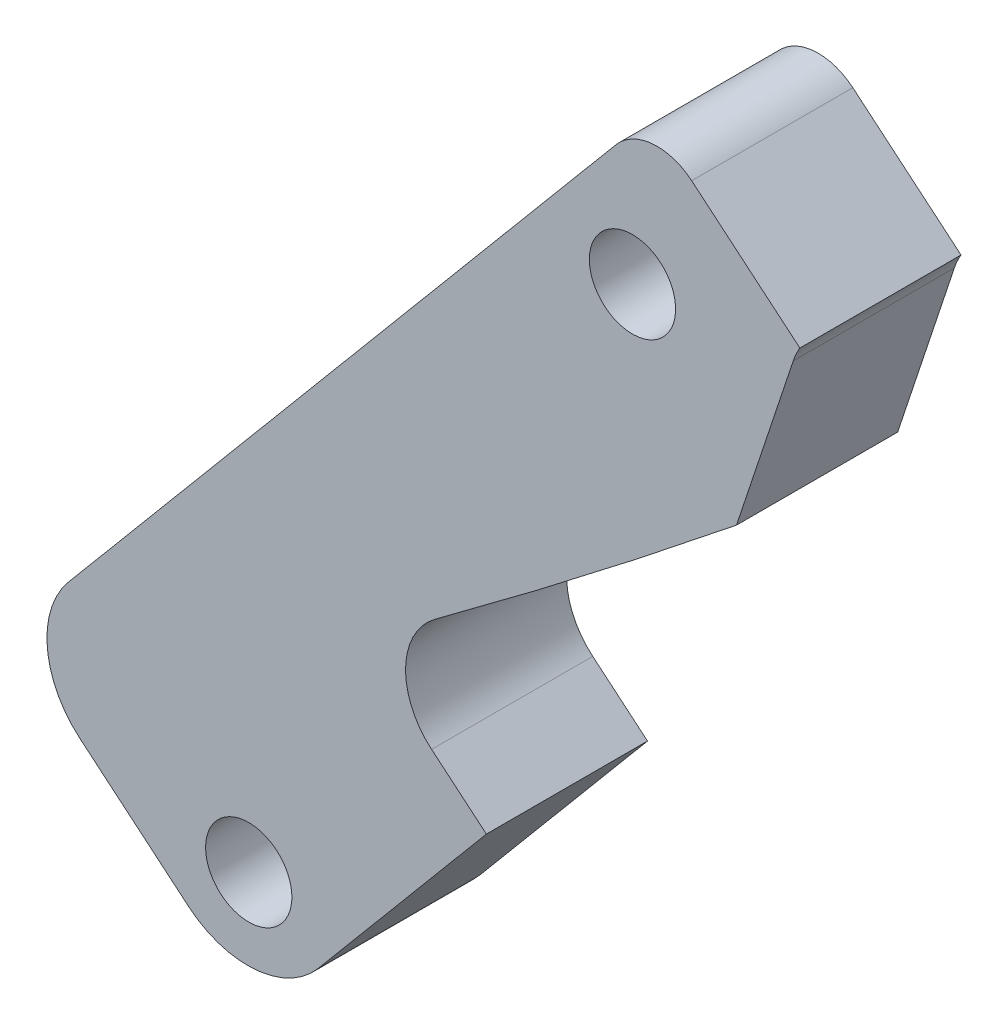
ISO-10303-21;
HEADER;
FILE_DESCRIPTION(('STEP AP214'),'2;1');
FILE_NAME('part.step','',(''),(''),'','','');
FILE_SCHEMA(('AUTOMOTIVE_DESIGN { 1 0 10303 214 1 1 1 1 }'));
ENDSEC;
DATA;
#1=APPLICATION_CONTEXT('core data for automotive mechanical design processes');
#2=APPLICATION_PROTOCOL_DEFINITION('international standard','automotive_design',2000,#1);
#3=PRODUCT_CONTEXT('',#1,'mechanical');
#4=PRODUCT('Part','Part','',(#3));
#5=PRODUCT_RELATED_PRODUCT_CATEGORY('part','',(#4));
#6=PRODUCT_DEFINITION_FORMATION('','',#4);
#7=PRODUCT_DEFINITION_CONTEXT('part definition',#1,'design');
#8=PRODUCT_DEFINITION('design','',#6,#7);
#9=PRODUCT_DEFINITION_SHAPE('','',#8);
#10=(LENGTH_UNIT() NAMED_UNIT(*) SI_UNIT(.MILLI.,.METRE.));
#11=(NAMED_UNIT(*) PLANE_ANGLE_UNIT() SI_UNIT($,.RADIAN.));
#12=(NAMED_UNIT(*) SI_UNIT($,.STERADIAN.) SOLID_ANGLE_UNIT());
#13=UNCERTAINTY_MEASURE_WITH_UNIT(LENGTH_MEASURE(1.E-05),#10,'distance_accuracy_value','');
#14=(GEOMETRIC_REPRESENTATION_CONTEXT(3) GLOBAL_UNCERTAINTY_ASSIGNED_CONTEXT((#13)) GLOBAL_UNIT_ASSIGNED_CONTEXT((#10,
#11,#12)) REPRESENTATION_CONTEXT('',''));
#15=CARTESIAN_POINT('',(0.,0.,0.));
#16=DIRECTION('',(0.,0.,1.));
#17=DIRECTION('',(1.,0.,0.));
#18=AXIS2_PLACEMENT_3D('',#15,#16,#17);
#19=CARTESIAN_POINT('',(-495.568692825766,-68.0283667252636,16.5349999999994));
#20=DIRECTION('',(0.,0.,-1.));
#21=DIRECTION('',(-1.,0.,0.));
#22=AXIS2_PLACEMENT_3D('',#19,#20,#21);
#23=CYLINDRICAL_SURFACE('',#22,6.03249999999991);
#24=DIRECTION('',(0.,0.,1.));
#25=VECTOR('',#24,1.);
#26=CARTESIAN_POINT('',(-499.4463090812,-72.6495298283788,3.19999999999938));
#27=LINE('',#26,#25);
#28=CARTESIAN_POINT('',(-499.4463090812,-72.6495298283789,3.19999999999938));
#29=VERTEX_POINT('',#28);
#30=CARTESIAN_POINT('',(-499.4463090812,-72.6495298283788,16.5349999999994));
#31=VERTEX_POINT('',#30);
#32=EDGE_CURVE('E414',#29,#31,#27,.T.);
#33=ORIENTED_EDGE('',*,*,#32,.F.);
#34=CARTESIAN_POINT('',(-495.568692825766,-68.0283667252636,3.19999999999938));
#35=DIRECTION('',(0.,0.,-1.));
#36=DIRECTION('',(-1.,0.,0.));
#37=AXIS2_PLACEMENT_3D('',#34,#35,#36);
#38=CIRCLE('',#37,6.03249999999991);
#39=CARTESIAN_POINT('',(-499.141552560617,-63.1677361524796,3.19999999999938));
#40=VERTEX_POINT('',#39);
#41=EDGE_CURVE('E349',#29,#40,#38,.T.);
#42=ORIENTED_EDGE('',*,*,#41,.T.);
#43=DIRECTION('',(0.,0.,-1.));
#44=VECTOR('',#43,1.);
#45=CARTESIAN_POINT('',(-499.141552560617,-63.1677361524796,16.5349999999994));
#46=LINE('',#45,#44);
#47=CARTESIAN_POINT('',(-499.141552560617,-63.1677361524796,16.5349999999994));
#48=VERTEX_POINT('',#47);
#49=EDGE_CURVE('E362',#48,#40,#46,.T.);
#50=ORIENTED_EDGE('',*,*,#49,.F.);
#51=CARTESIAN_POINT('',(-495.568692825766,-68.0283667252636,16.5349999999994));
#52=DIRECTION('',(0.,0.,-1.));
#53=DIRECTION('',(-1.,0.,0.));
#54=AXIS2_PLACEMENT_3D('',#51,#52,#53);
#55=CIRCLE('',#54,6.03249999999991);
#56=EDGE_CURVE('E334',#31,#48,#55,.T.);
#57=ORIENTED_EDGE('',*,*,#56,.F.);
#58=EDGE_LOOP('',(#33,#42,#50,#57));
#59=FACE_BOUND('',#58,.T.);
#60=ADVANCED_FACE('F63',(#59),#23,.F.);
#61=CARTESIAN_POINT('',(-523.655713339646,-80.5780466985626,16.5349999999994));
#62=DIRECTION('',(0.,0.,-1.));
#63=DIRECTION('',(-1.,0.,0.));
#64=AXIS2_PLACEMENT_3D('',#61,#62,#63);
#65=CYLINDRICAL_SURFACE('',#64,7.6200000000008);
#66=CARTESIAN_POINT('',(-523.655713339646,-80.5780466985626,3.19999999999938));
#67=DIRECTION('',(0.,0.,-1.));
#68=DIRECTION('',(-1.,0.,0.));
#69=AXIS2_PLACEMENT_3D('',#66,#67,#68);
#70=CIRCLE('',#69,7.6200000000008);
#71=CARTESIAN_POINT('',(-528.553754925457,-86.4153053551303,3.19999999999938));
#72=VERTEX_POINT('',#71);
#73=CARTESIAN_POINT('',(-529.492971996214,-75.6800051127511,3.19999999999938));
#74=VERTEX_POINT('',#73);
#75=EDGE_CURVE('E166',#72,#74,#70,.T.);
#76=ORIENTED_EDGE('',*,*,#75,.F.);
#77=DIRECTION('',(0.,0.,-1.));
#78=VECTOR('',#77,1.);
#79=CARTESIAN_POINT('',(-528.553754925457,-86.4153053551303,16.5349999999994));
#80=LINE('',#79,#78);
#81=CARTESIAN_POINT('',(-528.553754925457,-86.4153053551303,16.5349999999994));
#82=VERTEX_POINT('',#81);
#83=EDGE_CURVE('E13',#82,#72,#80,.T.);
#84=ORIENTED_EDGE('',*,*,#83,.F.);
#85=CARTESIAN_POINT('',(-523.655713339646,-80.5780466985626,16.5349999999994));
#86=DIRECTION('',(0.,0.,-1.));
#87=DIRECTION('',(-1.,0.,0.));
#88=AXIS2_PLACEMENT_3D('',#85,#86,#87);
#89=CIRCLE('',#88,7.6200000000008);
#90=CARTESIAN_POINT('',(-529.492971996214,-75.6800051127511,16.5349999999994));
#91=VERTEX_POINT('',#90);
#92=EDGE_CURVE('E191',#82,#91,#89,.T.);
#93=ORIENTED_EDGE('',*,*,#92,.T.);
#94=DIRECTION('',(0.,0.,-1.));
#95=VECTOR('',#94,1.);
#96=CARTESIAN_POINT('',(-529.492971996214,-75.6800051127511,16.5349999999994));
#97=LINE('',#96,#95);
#98=EDGE_CURVE('E67',#91,#74,#97,.T.);
#99=ORIENTED_EDGE('',*,*,#98,.T.);
#100=EDGE_LOOP('',(#76,#84,#93,#99));
#101=FACE_BOUND('',#100,.T.);
#102=ADVANCED_FACE('F65',(#101),#65,.T.);
#103=CARTESIAN_POINT('',(-519.554647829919,-93.9664527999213,16.5349999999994));
#104=DIRECTION('',(-0.642787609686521,-0.766044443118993,0.));
#105=DIRECTION('',(0.766044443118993,-0.642787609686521,0.));
#106=AXIS2_PLACEMENT_3D('',#103,#104,#105);
#107=PLANE('',#106);
#108=DIRECTION('',(-0.766044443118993,0.642787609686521,0.));
#109=VECTOR('',#108,1.);
#110=CARTESIAN_POINT('',(-519.554647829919,-93.9664527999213,3.19999999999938));
#111=LINE('',#110,#109);
#112=CARTESIAN_POINT('',(-519.554647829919,-93.9664527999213,3.19999999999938));
#113=VERTEX_POINT('',#112);
#114=EDGE_CURVE('E186',#113,#72,#111,.T.);
#115=ORIENTED_EDGE('',*,*,#114,.F.);
#116=DIRECTION('',(0.,0.,-1.));
#117=VECTOR('',#116,1.);
#118=CARTESIAN_POINT('',(-519.554647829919,-93.9664527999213,16.5349999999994));
#119=LINE('',#118,#117);
#120=CARTESIAN_POINT('',(-519.554647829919,-93.9664527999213,16.5349999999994));
#121=VERTEX_POINT('',#120);
#122=EDGE_CURVE('E73',#121,#113,#119,.T.);
#123=ORIENTED_EDGE('',*,*,#122,.F.);
#124=DIRECTION('',(-0.766044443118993,0.642787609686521,0.));
#125=VECTOR('',#124,1.);
#126=CARTESIAN_POINT('',(-519.554647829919,-93.9664527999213,16.5349999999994));
#127=LINE('',#126,#125);
#128=EDGE_CURVE('E159',#121,#82,#127,.T.);
#129=ORIENTED_EDGE('',*,*,#128,.T.);
#130=ORIENTED_EDGE('',*,*,#83,.T.);
#131=EDGE_LOOP('',(#115,#123,#129,#130));
#132=FACE_BOUND('',#131,.T.);
#133=ADVANCED_FACE('F207',(#132),#107,.T.);
#134=CARTESIAN_POINT('',(-514.656606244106,-88.1291941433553,16.5349999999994));
#135=DIRECTION('',(0.,0.,-1.));
#136=DIRECTION('',(-1.,0.,0.));
#137=AXIS2_PLACEMENT_3D('',#134,#135,#136);
#138=CYLINDRICAL_SURFACE('',#137,7.62000000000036);
#139=CARTESIAN_POINT('',(-514.656606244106,-88.1291941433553,3.19999999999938));
#140=DIRECTION('',(0.,0.,-1.));
#141=DIRECTION('',(-1.,0.,0.));
#142=AXIS2_PLACEMENT_3D('',#139,#140,#141);
#143=CIRCLE('',#142,7.62000000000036);
#144=CARTESIAN_POINT('',(-508.819347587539,-93.0272357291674,3.19999999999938));
#145=VERTEX_POINT('',#144);
#146=EDGE_CURVE('E154',#145,#113,#143,.T.);
#147=ORIENTED_EDGE('',*,*,#146,.F.);
#148=DIRECTION('',(0.,0.,-1.));
#149=VECTOR('',#148,1.);
#150=CARTESIAN_POINT('',(-508.819347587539,-93.0272357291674,16.5349999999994));
#151=LINE('',#150,#149);
#152=CARTESIAN_POINT('',(-508.819347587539,-93.0272357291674,16.5349999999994));
#153=VERTEX_POINT('',#152);
#154=EDGE_CURVE('E138',#153,#145,#151,.T.);
#155=ORIENTED_EDGE('',*,*,#154,.F.);
#156=CARTESIAN_POINT('',(-514.656606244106,-88.1291941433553,16.5349999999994));
#157=DIRECTION('',(0.,0.,-1.));
#158=DIRECTION('',(-1.,0.,0.));
#159=AXIS2_PLACEMENT_3D('',#156,#157,#158);
#160=CIRCLE('',#159,7.62000000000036);
#161=EDGE_CURVE('E146',#153,#121,#160,.T.);
#162=ORIENTED_EDGE('',*,*,#161,.T.);
#163=ORIENTED_EDGE('',*,*,#122,.T.);
#164=EDGE_LOOP('',(#147,#155,#162,#163));
#165=FACE_BOUND('',#164,.T.);
#166=ADVANCED_FACE('F151',(#165),#138,.T.);
#167=CARTESIAN_POINT('',(-463.512462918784,-39.0325931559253,16.5349999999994));
#168=DIRECTION('',(0.766044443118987,-0.642787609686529,0.));
#169=DIRECTION('',(0.642787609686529,0.766044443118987,0.));
#170=AXIS2_PLACEMENT_3D('',#167,#168,#169);
#171=PLANE('',#170);
#172=DIRECTION('',(0.,0.,1.));
#173=VECTOR('',#172,1.);
#174=CARTESIAN_POINT('',(-494.912572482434,-76.453786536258,3.19999999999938));
#175=LINE('',#174,#173);
#176=CARTESIAN_POINT('',(-494.912572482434,-76.453786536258,3.19999999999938));
#177=VERTEX_POINT('',#176);
#178=CARTESIAN_POINT('',(-494.912572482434,-76.453786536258,16.5349999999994));
#179=VERTEX_POINT('',#178);
#180=EDGE_CURVE('E141',#177,#179,#175,.T.);
#181=ORIENTED_EDGE('',*,*,#180,.T.);
#182=DIRECTION('',(-0.642787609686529,-0.766044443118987,0.));
#183=VECTOR('',#182,1.);
#184=CARTESIAN_POINT('',(-463.512462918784,-39.0325931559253,16.5349999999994));
#185=LINE('',#184,#183);
#186=EDGE_CURVE('E134',#179,#153,#185,.T.);
#187=ORIENTED_EDGE('',*,*,#186,.T.);
#188=ORIENTED_EDGE('',*,*,#154,.T.);
#189=DIRECTION('',(-0.642787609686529,-0.766044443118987,0.));
#190=VECTOR('',#189,1.);
#191=CARTESIAN_POINT('',(-463.512462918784,-39.0325931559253,3.19999999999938));
#192=LINE('',#191,#190);
#193=EDGE_CURVE('E187',#177,#145,#192,.T.);
#194=ORIENTED_EDGE('',*,*,#193,.F.);
#195=EDGE_LOOP('',(#181,#187,#188,#194));
#196=FACE_BOUND('',#195,.T.);
#197=ADVANCED_FACE('F136',(#196),#171,.T.);
#198=CARTESIAN_POINT('',(-477.923828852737,-21.137485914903,16.5349999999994));
#199=DIRECTION('',(0.642787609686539,0.766044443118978,0.));
#200=DIRECTION('',(-0.766044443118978,0.642787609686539,0.));
#201=AXIS2_PLACEMENT_3D('',#198,#199,#200);
#202=PLANE('',#201);
#203=DIRECTION('',(0.,0.,-1.));
#204=VECTOR('',#203,1.);
#205=CARTESIAN_POINT('',(-468.970441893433,-28.6502696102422,16.5349999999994));
#206=LINE('',#205,#204);
#207=CARTESIAN_POINT('',(-468.970441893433,-28.6502696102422,3.19999999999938));
#208=VERTEX_POINT('',#207);
#209=CARTESIAN_POINT('',(-468.970441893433,-28.6502696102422,16.5349999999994));
#210=VERTEX_POINT('',#209);
#211=EDGE_CURVE('E172',#208,#210,#206,.F.);
#212=ORIENTED_EDGE('',*,*,#211,.F.);
#213=DIRECTION('',(0.766044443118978,-0.642787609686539,0.));
#214=VECTOR('',#213,1.);
#215=CARTESIAN_POINT('',(-477.923828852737,-21.137485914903,3.19999999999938));
#216=LINE('',#215,#214);
#217=CARTESIAN_POINT('',(-477.923828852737,-21.137485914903,3.19999999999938));
#218=VERTEX_POINT('',#217);
#219=EDGE_CURVE('E330',#218,#208,#216,.T.);
#220=ORIENTED_EDGE('',*,*,#219,.F.);
#221=DIRECTION('',(0.,0.,-1.));
#222=VECTOR('',#221,1.);
#223=CARTESIAN_POINT('',(-477.923828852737,-21.137485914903,16.5349999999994));
#224=LINE('',#223,#222);
#225=CARTESIAN_POINT('',(-477.923828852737,-21.137485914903,16.5349999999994));
#226=VERTEX_POINT('',#225);
#227=EDGE_CURVE('E156',#226,#218,#224,.T.);
#228=ORIENTED_EDGE('',*,*,#227,.F.);
#229=DIRECTION('',(0.766044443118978,-0.642787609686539,0.));
#230=VECTOR('',#229,1.);
#231=CARTESIAN_POINT('',(-477.923828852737,-21.137485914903,16.5349999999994));
#232=LINE('',#231,#230);
#233=EDGE_CURVE('E147',#226,#210,#232,.T.);
#234=ORIENTED_EDGE('',*,*,#233,.T.);
#235=EDGE_LOOP('',(#212,#220,#228,#234));
#236=FACE_BOUND('',#235,.T.);
#237=ADVANCED_FACE('F381',(#236),#202,.T.);
#238=CARTESIAN_POINT('',(-480.781019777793,-24.5425534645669,16.5349999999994));
#239=DIRECTION('',(0.,0.,-1.));
#240=DIRECTION('',(-1.,0.,0.));
#241=AXIS2_PLACEMENT_3D('',#238,#239,#240);
#242=CYLINDRICAL_SURFACE('',#241,4.44500000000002);
#243=CARTESIAN_POINT('',(-480.781019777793,-24.5425534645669,3.19999999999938));
#244=DIRECTION('',(0.,0.,-1.));
#245=DIRECTION('',(-1.,0.,0.));
#246=AXIS2_PLACEMENT_3D('',#243,#244,#245);
#247=CIRCLE('',#246,4.44500000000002);
#248=CARTESIAN_POINT('',(-484.186087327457,-21.6853625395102,3.19999999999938));
#249=VERTEX_POINT('',#248);
#250=EDGE_CURVE('E205',#249,#218,#247,.T.);
#251=ORIENTED_EDGE('',*,*,#250,.F.);
#252=DIRECTION('',(0.,0.,-1.));
#253=VECTOR('',#252,1.);
#254=CARTESIAN_POINT('',(-484.186087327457,-21.6853625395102,16.5349999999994));
#255=LINE('',#254,#253);
#256=CARTESIAN_POINT('',(-484.186087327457,-21.6853625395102,16.5349999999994));
#257=VERTEX_POINT('',#256);
#258=EDGE_CURVE('E196',#257,#249,#255,.T.);
#259=ORIENTED_EDGE('',*,*,#258,.F.);
#260=CARTESIAN_POINT('',(-480.781019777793,-24.5425534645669,16.5349999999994));
#261=DIRECTION('',(0.,0.,-1.));
#262=DIRECTION('',(-1.,0.,0.));
#263=AXIS2_PLACEMENT_3D('',#260,#261,#262);
#264=CIRCLE('',#263,4.44500000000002);
#265=EDGE_CURVE('E374',#257,#226,#264,.T.);
#266=ORIENTED_EDGE('',*,*,#265,.T.);
#267=ORIENTED_EDGE('',*,*,#227,.T.);
#268=EDGE_LOOP('',(#251,#259,#266,#267));
#269=FACE_BOUND('',#268,.T.);
#270=ADVANCED_FACE('F386',(#269),#242,.T.);
#271=CARTESIAN_POINT('',(-529.492971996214,-75.6800051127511,16.5349999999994));
#272=DIRECTION('',(-0.766044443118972,0.642787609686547,0.));
#273=DIRECTION('',(-0.642787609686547,-0.766044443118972,0.));
#274=AXIS2_PLACEMENT_3D('',#271,#272,#273);
#275=PLANE('',#274);
#276=DIRECTION('',(0.642787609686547,0.766044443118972,0.));
#277=VECTOR('',#276,1.);
#278=CARTESIAN_POINT('',(-529.492971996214,-75.6800051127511,3.19999999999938));
#279=LINE('',#278,#277);
#280=EDGE_CURVE('E171',#74,#249,#279,.T.);
#281=ORIENTED_EDGE('',*,*,#280,.F.);
#282=ORIENTED_EDGE('',*,*,#98,.F.);
#283=DIRECTION('',(0.642787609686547,0.766044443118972,0.));
#284=VECTOR('',#283,1.);
#285=CARTESIAN_POINT('',(-529.492971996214,-75.6800051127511,16.5349999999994));
#286=LINE('',#285,#284);
#287=EDGE_CURVE('E371',#91,#257,#286,.T.);
#288=ORIENTED_EDGE('',*,*,#287,.T.);
#289=ORIENTED_EDGE('',*,*,#258,.T.);
#290=EDGE_LOOP('',(#281,#282,#288,#289));
#291=FACE_BOUND('',#290,.T.);
#292=ADVANCED_FACE('F201',(#291),#275,.T.);
#293=CARTESIAN_POINT('',(-523.655713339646,-80.5780466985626,16.5349999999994));
#294=DIRECTION('',(0.,0.,-1.));
#295=DIRECTION('',(-1.,0.,0.));
#296=AXIS2_PLACEMENT_3D('',#293,#294,#295);
#297=PLANE('',#296);
#298=CARTESIAN_POINT('',(-482.821795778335,-31.0085922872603,16.5349999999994));
#299=DIRECTION('',(0.,0.,-1.));
#300=DIRECTION('',(-1.,0.,0.));
#301=AXIS2_PLACEMENT_3D('',#298,#299,#300);
#302=CIRCLE('',#301,3.56869999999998);
#303=CARTESIAN_POINT('',(-486.390495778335,-31.0085922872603,16.5349999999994));
#304=VERTEX_POINT('',#303);
#305=EDGE_CURVE('E546',#304,#304,#302,.T.);
#306=ORIENTED_EDGE('',*,*,#305,.T.);
#307=EDGE_LOOP('',(#306));
#308=FACE_BOUND('',#307,.T.);
#309=CARTESIAN_POINT('',(-514.578338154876,-89.0238024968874,16.5349999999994));
#310=DIRECTION('',(0.,0.,-1.));
#311=DIRECTION('',(-1.,0.,0.));
#312=AXIS2_PLACEMENT_3D('',#309,#310,#311);
#313=CIRCLE('',#312,3.56869999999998);
#314=CARTESIAN_POINT('',(-518.147038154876,-89.0238024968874,16.5349999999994));
#315=VERTEX_POINT('',#314);
#316=EDGE_CURVE('E270',#315,#315,#313,.T.);
#317=ORIENTED_EDGE('',*,*,#316,.T.);
#318=EDGE_LOOP('',(#317));
#319=FACE_BOUND('',#318,.T.);
#320=ORIENTED_EDGE('',*,*,#186,.F.);
#321=DIRECTION('',(0.76604444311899,-0.642787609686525,0.));
#322=VECTOR('',#321,1.);
#323=CARTESIAN_POINT('',(-494.912572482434,-76.453786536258,16.5349999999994));
#324=LINE('',#323,#322);
#325=EDGE_CURVE('E249',#31,#179,#324,.T.);
#326=ORIENTED_EDGE('',*,*,#325,.F.);
#327=ORIENTED_EDGE('',*,*,#56,.T.);
#328=CARTESIAN_POINT('',(-912.977322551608,499.827439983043,16.5349999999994));
#329=DIRECTION('',(0.,0.,1.));
#330=DIRECTION('',(-1.,0.,0.));
#331=AXIS2_PLACEMENT_3D('',#328,#329,#330);
#332=CIRCLE('',#331,698.729999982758);
#333=CARTESIAN_POINT('',(-474.213638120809,-43.9648384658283,16.5349999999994));
#334=VERTEX_POINT('',#333);
#335=EDGE_CURVE('E338',#48,#334,#332,.T.);
#336=ORIENTED_EDGE('',*,*,#335,.T.);
#337=DIRECTION('',(0.31550026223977,0.948925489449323,0.));
#338=VECTOR('',#337,1.);
#339=CARTESIAN_POINT('',(-474.213638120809,-43.9648384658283,16.5349999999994));
#340=LINE('',#339,#338);
#341=CARTESIAN_POINT('',(-469.519631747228,-29.8467446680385,16.5349999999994));
#342=VERTEX_POINT('',#341);
#343=EDGE_CURVE('E407',#334,#342,#340,.T.);
#344=ORIENTED_EDGE('',*,*,#343,.T.);
#345=CARTESIAN_POINT('',(-463.795238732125,-31.75,16.5349999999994));
#346=DIRECTION('',(0.,0.,-1.));
#347=DIRECTION('',(-1.,0.,0.));
#348=AXIS2_PLACEMENT_3D('',#345,#346,#347);
#349=CIRCLE('',#348,6.03249999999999);
#350=EDGE_CURVE('E354',#342,#210,#349,.T.);
#351=ORIENTED_EDGE('',*,*,#350,.T.);
#352=ORIENTED_EDGE('',*,*,#233,.F.);
#353=ORIENTED_EDGE('',*,*,#265,.F.);
#354=ORIENTED_EDGE('',*,*,#287,.F.);
#355=ORIENTED_EDGE('',*,*,#92,.F.);
#356=ORIENTED_EDGE('',*,*,#128,.F.);
#357=ORIENTED_EDGE('',*,*,#161,.F.);
#358=EDGE_LOOP('',(#320,#326,#327,#336,#344,#351,#352,#353,#354,#355,#356,#357));
#359=FACE_BOUND('',#358,.T.);
#360=ADVANCED_FACE('F158',(#308,#319,#359),#297,.F.);
#361=CARTESIAN_POINT('',(-523.655713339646,-80.5780466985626,3.19999999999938));
#362=DIRECTION('',(0.,0.,-1.));
#363=DIRECTION('',(-1.,0.,0.));
#364=AXIS2_PLACEMENT_3D('',#361,#362,#363);
#365=PLANE('',#364);
#366=CARTESIAN_POINT('',(-482.821795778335,-31.0085922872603,3.19999999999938));
#367=DIRECTION('',(0.,0.,-1.));
#368=DIRECTION('',(-1.,0.,0.));
#369=AXIS2_PLACEMENT_3D('',#366,#367,#368);
#370=CIRCLE('',#369,5.35940000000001);
#371=CARTESIAN_POINT('',(-488.181195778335,-31.0085922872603,3.19999999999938));
#372=VERTEX_POINT('',#371);
#373=EDGE_CURVE('E243',#372,#372,#370,.T.);
#374=ORIENTED_EDGE('',*,*,#373,.F.);
#375=EDGE_LOOP('',(#374));
#376=FACE_BOUND('',#375,.T.);
#377=CARTESIAN_POINT('',(-514.578338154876,-89.0238024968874,3.19999999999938));
#378=DIRECTION('',(0.,0.,-1.));
#379=DIRECTION('',(-1.,0.,0.));
#380=AXIS2_PLACEMENT_3D('',#377,#378,#379);
#381=CIRCLE('',#380,5.35940000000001);
#382=CARTESIAN_POINT('',(-519.937738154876,-89.0238024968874,3.19999999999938));
#383=VERTEX_POINT('',#382);
#384=EDGE_CURVE('E246',#383,#383,#381,.T.);
#385=ORIENTED_EDGE('',*,*,#384,.F.);
#386=EDGE_LOOP('',(#385));
#387=FACE_BOUND('',#386,.T.);
#388=DIRECTION('',(0.76604444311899,-0.642787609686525,0.));
#389=VECTOR('',#388,1.);
#390=CARTESIAN_POINT('',(-494.912572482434,-76.453786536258,3.19999999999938));
#391=LINE('',#390,#389);
#392=EDGE_CURVE('E81',#29,#177,#391,.T.);
#393=ORIENTED_EDGE('',*,*,#392,.T.);
#394=ORIENTED_EDGE('',*,*,#193,.T.);
#395=ORIENTED_EDGE('',*,*,#146,.T.);
#396=ORIENTED_EDGE('',*,*,#114,.T.);
#397=ORIENTED_EDGE('',*,*,#75,.T.);
#398=ORIENTED_EDGE('',*,*,#280,.T.);
#399=ORIENTED_EDGE('',*,*,#250,.T.);
#400=ORIENTED_EDGE('',*,*,#219,.T.);
#401=CARTESIAN_POINT('',(-463.795238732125,-31.75,3.19999999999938));
#402=DIRECTION('',(0.,0.,-1.));
#403=DIRECTION('',(-1.,0.,0.));
#404=AXIS2_PLACEMENT_3D('',#401,#402,#403);
#405=CIRCLE('',#404,6.03249999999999);
#406=CARTESIAN_POINT('',(-469.519631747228,-29.8467446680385,3.19999999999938));
#407=VERTEX_POINT('',#406);
#408=EDGE_CURVE('E323',#407,#208,#405,.T.);
#409=ORIENTED_EDGE('',*,*,#408,.F.);
#410=DIRECTION('',(0.31550026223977,0.948925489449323,0.));
#411=VECTOR('',#410,1.);
#412=CARTESIAN_POINT('',(-474.213638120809,-43.9648384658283,3.19999999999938));
#413=LINE('',#412,#411);
#414=CARTESIAN_POINT('',(-474.213638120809,-43.9648384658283,3.19999999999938));
#415=VERTEX_POINT('',#414);
#416=EDGE_CURVE('E308',#415,#407,#413,.T.);
#417=ORIENTED_EDGE('',*,*,#416,.F.);
#418=CARTESIAN_POINT('',(-912.977322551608,499.827439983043,3.19999999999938));
#419=DIRECTION('',(0.,0.,1.));
#420=DIRECTION('',(-1.,0.,0.));
#421=AXIS2_PLACEMENT_3D('',#418,#419,#420);
#422=CIRCLE('',#421,698.729999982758);
#423=EDGE_CURVE('E324',#40,#415,#422,.T.);
#424=ORIENTED_EDGE('',*,*,#423,.F.);
#425=ORIENTED_EDGE('',*,*,#41,.F.);
#426=EDGE_LOOP('',(#393,#394,#395,#396,#397,#398,#399,#400,#409,#417,#424,#425));
#427=FACE_BOUND('',#426,.T.);
#428=ADVANCED_FACE('F206',(#376,#387,#427),#365,.T.);
#429=CARTESIAN_POINT('',(-463.795238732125,-31.75,16.5349999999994));
#430=DIRECTION('',(0.,0.,-1.));
#431=DIRECTION('',(-1.,0.,0.));
#432=AXIS2_PLACEMENT_3D('',#429,#430,#431);
#433=CYLINDRICAL_SURFACE('',#432,6.03249999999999);
#434=ORIENTED_EDGE('',*,*,#211,.T.);
#435=ORIENTED_EDGE('',*,*,#350,.F.);
#436=DIRECTION('',(0.,0.,-1.));
#437=VECTOR('',#436,1.);
#438=CARTESIAN_POINT('',(-469.519631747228,-29.8467446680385,16.5349999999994));
#439=LINE('',#438,#437);
#440=EDGE_CURVE('E313',#342,#407,#439,.T.);
#441=ORIENTED_EDGE('',*,*,#440,.T.);
#442=ORIENTED_EDGE('',*,*,#408,.T.);
#443=EDGE_LOOP('',(#434,#435,#441,#442));
#444=FACE_BOUND('',#443,.T.);
#445=ADVANCED_FACE('F230',(#444),#433,.F.);
#446=CARTESIAN_POINT('',(-474.213638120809,-43.9648384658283,16.5349999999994));
#447=DIRECTION('',(-0.948925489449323,0.31550026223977,0.));
#448=DIRECTION('',(-0.31550026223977,-0.948925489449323,0.));
#449=AXIS2_PLACEMENT_3D('',#446,#447,#448);
#450=PLANE('',#449);
#451=ORIENTED_EDGE('',*,*,#416,.T.);
#452=ORIENTED_EDGE('',*,*,#440,.F.);
#453=ORIENTED_EDGE('',*,*,#343,.F.);
#454=DIRECTION('',(0.,0.,-1.));
#455=VECTOR('',#454,1.);
#456=CARTESIAN_POINT('',(-474.213638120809,-43.9648384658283,16.5349999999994));
#457=LINE('',#456,#455);
#458=EDGE_CURVE('E317',#334,#415,#457,.T.);
#459=ORIENTED_EDGE('',*,*,#458,.T.);
#460=EDGE_LOOP('',(#451,#452,#453,#459));
#461=FACE_BOUND('',#460,.T.);
#462=ADVANCED_FACE('F237',(#461),#450,.F.);
#463=CARTESIAN_POINT('',(-912.977322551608,499.827439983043,16.5349999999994));
#464=DIRECTION('',(0.,0.,-1.));
#465=DIRECTION('',(-1.,0.,0.));
#466=AXIS2_PLACEMENT_3D('',#463,#464,#465);
#467=CYLINDRICAL_SURFACE('',#466,698.729999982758);
#468=ORIENTED_EDGE('',*,*,#423,.T.);
#469=ORIENTED_EDGE('',*,*,#458,.F.);
#470=ORIENTED_EDGE('',*,*,#335,.F.);
#471=ORIENTED_EDGE('',*,*,#49,.T.);
#472=EDGE_LOOP('',(#468,#469,#470,#471));
#473=FACE_BOUND('',#472,.T.);
#474=ADVANCED_FACE('F225',(#473),#467,.T.);
#475=CARTESIAN_POINT('',(-494.912572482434,-76.453786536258,3.19999999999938));
#476=DIRECTION('',(-0.642787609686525,-0.76604444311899,0.));
#477=DIRECTION('',(0.76604444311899,-0.642787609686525,0.));
#478=AXIS2_PLACEMENT_3D('',#475,#476,#477);
#479=PLANE('',#478);
#480=ORIENTED_EDGE('',*,*,#325,.T.);
#481=ORIENTED_EDGE('',*,*,#180,.F.);
#482=ORIENTED_EDGE('',*,*,#392,.F.);
#483=ORIENTED_EDGE('',*,*,#32,.T.);
#484=EDGE_LOOP('',(#480,#481,#482,#483));
#485=FACE_BOUND('',#484,.T.);
#486=ADVANCED_FACE('F292',(#485),#479,.F.);
#487=CARTESIAN_POINT('',(-514.578338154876,-89.0238024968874,3.19999999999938));
#488=DIRECTION('',(0.,0.,-1.));
#489=DIRECTION('',(-1.,0.,0.));
#490=AXIS2_PLACEMENT_3D('',#487,#488,#489);
#491=CYLINDRICAL_SURFACE('',#490,5.35940000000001);
#492=CARTESIAN_POINT('',(-514.578338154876,-89.0238024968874,11.0739999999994));
#493=DIRECTION('',(0.,0.,-1.));
#494=DIRECTION('',(-1.,0.,0.));
#495=AXIS2_PLACEMENT_3D('',#492,#493,#494);
#496=CIRCLE('',#495,5.35940000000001);
#497=CARTESIAN_POINT('',(-519.937738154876,-89.0238024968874,11.0739999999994));
#498=VERTEX_POINT('',#497);
#499=EDGE_CURVE('E250',#498,#498,#496,.T.);
#500=ORIENTED_EDGE('',*,*,#499,.F.);
#501=EDGE_LOOP('',(#500));
#502=FACE_BOUND('',#501,.T.);
#503=ORIENTED_EDGE('',*,*,#384,.T.);
#504=EDGE_LOOP('',(#503));
#505=FACE_BOUND('',#504,.T.);
#506=ADVANCED_FACE('F287',(#502,#505),#491,.F.);
#507=CARTESIAN_POINT('',(-511.009638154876,-89.0238024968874,11.0739999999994));
#508=DIRECTION('',(0.,0.,1.));
#509=DIRECTION('',(1.,0.,0.));
#510=AXIS2_PLACEMENT_3D('',#507,#508,#509);
#511=PLANE('',#510);
#512=CARTESIAN_POINT('',(-514.578338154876,-89.0238024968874,11.0739999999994));
#513=DIRECTION('',(0.,0.,-1.));
#514=DIRECTION('',(-1.,0.,0.));
#515=AXIS2_PLACEMENT_3D('',#512,#513,#514);
#516=CIRCLE('',#515,3.56869999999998);
#517=CARTESIAN_POINT('',(-518.147038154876,-89.0238024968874,11.0739999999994));
#518=VERTEX_POINT('',#517);
#519=EDGE_CURVE('E257',#518,#518,#516,.T.);
#520=ORIENTED_EDGE('',*,*,#519,.F.);
#521=EDGE_LOOP('',(#520));
#522=FACE_BOUND('',#521,.T.);
#523=ORIENTED_EDGE('',*,*,#499,.T.);
#524=EDGE_LOOP('',(#523));
#525=FACE_BOUND('',#524,.T.);
#526=ADVANCED_FACE('F284',(#522,#525),#511,.F.);
#527=CARTESIAN_POINT('',(-514.578338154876,-89.0238024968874,3.19999999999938));
#528=DIRECTION('',(0.,0.,-1.));
#529=DIRECTION('',(-1.,0.,0.));
#530=AXIS2_PLACEMENT_3D('',#527,#528,#529);
#531=CYLINDRICAL_SURFACE('',#530,3.56869999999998);
#532=ORIENTED_EDGE('',*,*,#316,.F.);
#533=EDGE_LOOP('',(#532));
#534=FACE_BOUND('',#533,.T.);
#535=ORIENTED_EDGE('',*,*,#519,.T.);
#536=EDGE_LOOP('',(#535));
#537=FACE_BOUND('',#536,.T.);
#538=ADVANCED_FACE('F282',(#534,#537),#531,.F.);
#539=CARTESIAN_POINT('',(-482.821795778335,-31.0085922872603,3.19999999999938));
#540=DIRECTION('',(0.,0.,-1.));
#541=DIRECTION('',(-1.,0.,0.));
#542=AXIS2_PLACEMENT_3D('',#539,#540,#541);
#543=CYLINDRICAL_SURFACE('',#542,5.35940000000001);
#544=CARTESIAN_POINT('',(-482.821795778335,-31.0085922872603,11.0739999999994));
#545=DIRECTION('',(0.,0.,-1.));
#546=DIRECTION('',(-1.,0.,0.));
#547=AXIS2_PLACEMENT_3D('',#544,#545,#546);
#548=CIRCLE('',#547,5.35940000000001);
#549=CARTESIAN_POINT('',(-488.181195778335,-31.0085922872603,11.0739999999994));
#550=VERTEX_POINT('',#549);
#551=EDGE_CURVE('E551',#550,#550,#548,.T.);
#552=ORIENTED_EDGE('',*,*,#551,.F.);
#553=EDGE_LOOP('',(#552));
#554=FACE_BOUND('',#553,.T.);
#555=ORIENTED_EDGE('',*,*,#373,.T.);
#556=EDGE_LOOP('',(#555));
#557=FACE_BOUND('',#556,.T.);
#558=ADVANCED_FACE('F493',(#554,#557),#543,.F.);
#559=CARTESIAN_POINT('',(-479.253095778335,-31.0085922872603,11.0739999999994));
#560=DIRECTION('',(0.,0.,1.));
#561=DIRECTION('',(1.,0.,0.));
#562=AXIS2_PLACEMENT_3D('',#559,#560,#561);
#563=PLANE('',#562);
#564=CARTESIAN_POINT('',(-482.821795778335,-31.0085922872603,11.0739999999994));
#565=DIRECTION('',(0.,0.,-1.));
#566=DIRECTION('',(-1.,0.,0.));
#567=AXIS2_PLACEMENT_3D('',#564,#565,#566);
#568=CIRCLE('',#567,3.56869999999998);
#569=CARTESIAN_POINT('',(-486.390495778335,-31.0085922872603,11.0739999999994));
#570=VERTEX_POINT('',#569);
#571=EDGE_CURVE('E549',#570,#570,#568,.T.);
#572=ORIENTED_EDGE('',*,*,#571,.F.);
#573=EDGE_LOOP('',(#572));
#574=FACE_BOUND('',#573,.T.);
#575=ORIENTED_EDGE('',*,*,#551,.T.);
#576=EDGE_LOOP('',(#575));
#577=FACE_BOUND('',#576,.T.);
#578=ADVANCED_FACE('F502',(#574,#577),#563,.F.);
#579=CARTESIAN_POINT('',(-482.821795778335,-31.0085922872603,3.19999999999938));
#580=DIRECTION('',(0.,0.,-1.));
#581=DIRECTION('',(-1.,0.,0.));
#582=AXIS2_PLACEMENT_3D('',#579,#580,#581);
#583=CYLINDRICAL_SURFACE('',#582,3.56869999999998);
#584=ORIENTED_EDGE('',*,*,#305,.F.);
#585=EDGE_LOOP('',(#584));
#586=FACE_BOUND('',#585,.T.);
#587=ORIENTED_EDGE('',*,*,#571,.T.);
#588=EDGE_LOOP('',(#587));
#589=FACE_BOUND('',#588,.T.);
#590=ADVANCED_FACE('F512',(#586,#589),#583,.F.);
#591=CLOSED_SHELL('',(#60,#102,#133,#166,#197,#237,#270,#292,#360,#428,#445,#462,#474,#486,#506,
#526,#538,#558,#578,#590));
#592=MANIFOLD_SOLID_BREP('B2',#591);
#593=ADVANCED_BREP_SHAPE_REPRESENTATION('',(#18,#592),#14);
#594=SHAPE_DEFINITION_REPRESENTATION(#9,#593);
ENDSEC;
END-ISO-10303-21;
